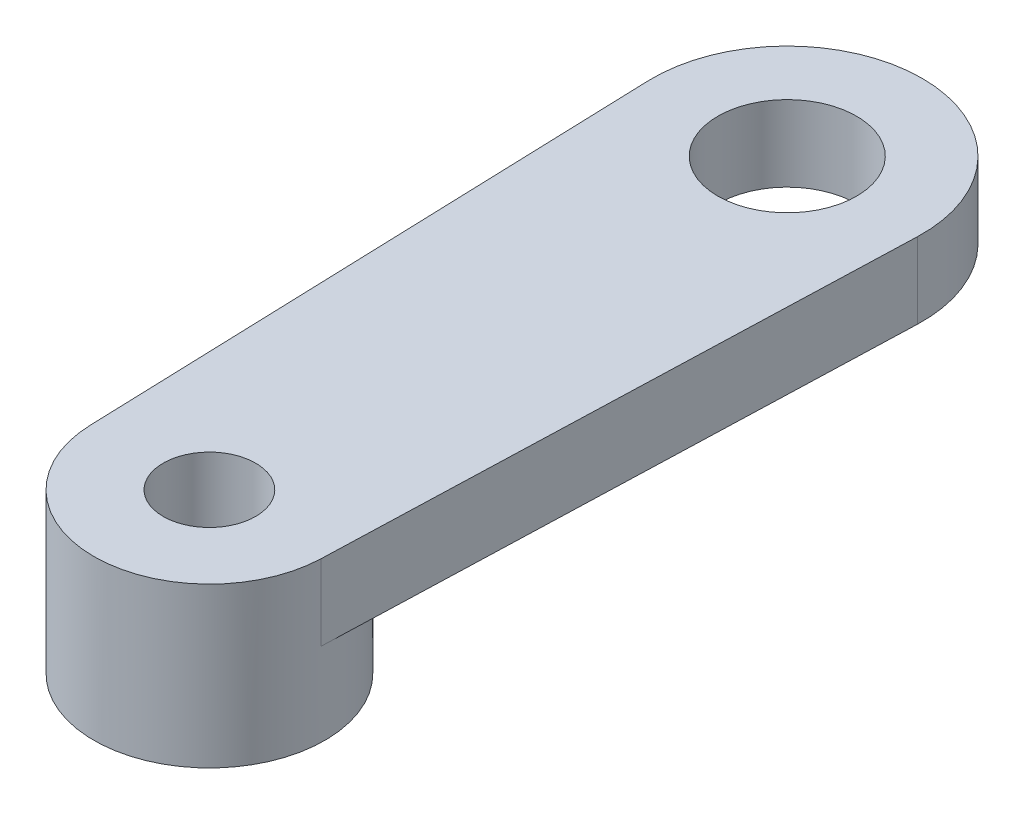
from build123d import *

# Parameters (mm, degrees)
SKETCH1_R           = 2.286
SKETCH1_R_2         = 1.524
BOSS_EXTRUDE1_DEPTH = 2.5
BOSS_EXTRUDE3_START = 2.75
SKETCH2_R           = 3.81
SKETCH2_R_2         = 2.44856
BOSS_EXTRUDE3_DEPTH = 2.75


with BuildPart() as part:
    # Sketch1 → Boss-Extrude1 (new body)
    with BuildSketch(Plane(origin=(0, 0, 0), x_dir=(1, 0, 0), z_dir=(0, 1, 0))):
        with BuildLine():
            Line((-3.807866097, -0.12749819), (-4.445, 18.901168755))
            ThreePointArc((-4.445, 18.901168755), (0, 23.497490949), (4.445, 18.901168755))
            Line((4.445, 18.901168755), (3.807866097, -0.12749819))
            ThreePointArc((3.807866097, -0.12749819), (0, -3.81), (-3.807866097, -0.12749819))
        make_face()
        with Locations(Location((0, 19.05, 0), (0, 0, 270))):
            Circle(SKETCH1_R, mode=Mode.SUBTRACT)
        with Locations(Location((0, 0, 0), (0, 0, 270))):
            Circle(SKETCH1_R_2, mode=Mode.SUBTRACT)
    extrude(amount=BOSS_EXTRUDE1_DEPTH)

    # Sketch2 → Boss-Extrude3 (add)
    with BuildSketch(Plane.XZ.offset(BOSS_EXTRUDE3_START)):
        with Locations(Location((0, 0, 0), (0, 0, 270))):
            Circle(SKETCH2_R)
        with Locations(Location((0, 0, 0), (0, 0, 270))):
            Circle(SKETCH2_R_2, mode=Mode.SUBTRACT)
    extrude(amount=-BOSS_EXTRUDE3_DEPTH)


solid = part.part
